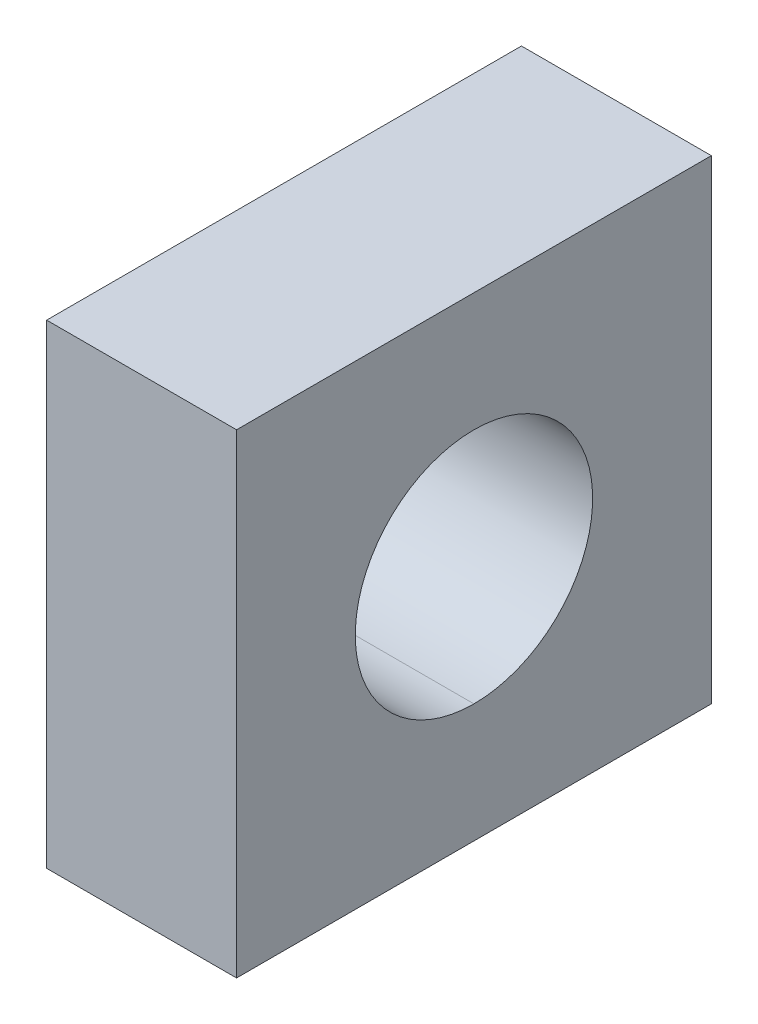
ISO-10303-21;
HEADER;
FILE_DESCRIPTION(('STEP AP214'),'2;1');
FILE_NAME('part.step','',(''),(''),'','','');
FILE_SCHEMA(('AUTOMOTIVE_DESIGN { 1 0 10303 214 1 1 1 1 }'));
ENDSEC;
DATA;
#1=APPLICATION_CONTEXT('core data for automotive mechanical design processes');
#2=APPLICATION_PROTOCOL_DEFINITION('international standard','automotive_design',2000,#1);
#3=PRODUCT_CONTEXT('',#1,'mechanical');
#4=PRODUCT('Part','Part','',(#3));
#5=PRODUCT_RELATED_PRODUCT_CATEGORY('part','',(#4));
#6=PRODUCT_DEFINITION_FORMATION('','',#4);
#7=PRODUCT_DEFINITION_CONTEXT('part definition',#1,'design');
#8=PRODUCT_DEFINITION('design','',#6,#7);
#9=PRODUCT_DEFINITION_SHAPE('','',#8);
#10=(LENGTH_UNIT() NAMED_UNIT(*) SI_UNIT(.MILLI.,.METRE.));
#11=(NAMED_UNIT(*) PLANE_ANGLE_UNIT() SI_UNIT($,.RADIAN.));
#12=(NAMED_UNIT(*) SI_UNIT($,.STERADIAN.) SOLID_ANGLE_UNIT());
#13=UNCERTAINTY_MEASURE_WITH_UNIT(LENGTH_MEASURE(1.E-05),#10,'distance_accuracy_value','');
#14=(GEOMETRIC_REPRESENTATION_CONTEXT(3) GLOBAL_UNCERTAINTY_ASSIGNED_CONTEXT((#13)) GLOBAL_UNIT_ASSIGNED_CONTEXT((#10,
#11,#12)) REPRESENTATION_CONTEXT('',''));
#15=CARTESIAN_POINT('',(0.,0.,0.));
#16=DIRECTION('',(0.,0.,1.));
#17=DIRECTION('',(1.,0.,0.));
#18=AXIS2_PLACEMENT_3D('',#15,#16,#17);
#19=CARTESIAN_POINT('',(-3.175,0.,0.));
#20=DIRECTION('',(1.,0.,0.));
#21=DIRECTION('',(0.,0.,-1.));
#22=AXIS2_PLACEMENT_3D('',#19,#20,#21);
#23=PLANE('',#22);
#24=DIRECTION('',(0.,1.,0.));
#25=VECTOR('',#24,1.);
#26=CARTESIAN_POINT('',(-3.175,0.,7.9375));
#27=LINE('',#26,#25);
#28=CARTESIAN_POINT('',(-3.175,-7.9375,7.9375));
#29=VERTEX_POINT('',#28);
#30=CARTESIAN_POINT('',(-3.175,7.9375,7.9375));
#31=VERTEX_POINT('',#30);
#32=EDGE_CURVE('E100',#29,#31,#27,.T.);
#33=ORIENTED_EDGE('',*,*,#32,.T.);
#34=DIRECTION('',(0.,0.,-1.));
#35=VECTOR('',#34,1.);
#36=CARTESIAN_POINT('',(-3.175,7.9375,0.));
#37=LINE('',#36,#35);
#38=CARTESIAN_POINT('',(-3.175,7.9375,-7.9375));
#39=VERTEX_POINT('',#38);
#40=EDGE_CURVE('E96',#31,#39,#37,.T.);
#41=ORIENTED_EDGE('',*,*,#40,.T.);
#42=DIRECTION('',(0.,1.,0.));
#43=VECTOR('',#42,1.);
#44=CARTESIAN_POINT('',(-3.175,0.,-7.9375));
#45=LINE('',#44,#43);
#46=CARTESIAN_POINT('',(-3.175,-7.9375,-7.9375));
#47=VERTEX_POINT('',#46);
#48=EDGE_CURVE('E92',#39,#47,#45,.F.);
#49=ORIENTED_EDGE('',*,*,#48,.T.);
#50=DIRECTION('',(0.,0.,1.));
#51=VECTOR('',#50,1.);
#52=CARTESIAN_POINT('',(-3.175,-7.9375,0.));
#53=LINE('',#52,#51);
#54=EDGE_CURVE('E80',#47,#29,#53,.T.);
#55=ORIENTED_EDGE('',*,*,#54,.T.);
#56=EDGE_LOOP('',(#33,#41,#49,#55));
#57=FACE_BOUND('',#56,.T.);
#58=CARTESIAN_POINT('',(-3.175,0.,0.));
#59=DIRECTION('',(-1.,0.,0.));
#60=DIRECTION('',(0.,0.,1.));
#61=AXIS2_PLACEMENT_3D('',#58,#59,#60);
#62=CIRCLE('',#61,3.96875);
#63=CARTESIAN_POINT('',(-3.175,-3.96875,0.));
#64=VERTEX_POINT('',#63);
#65=CARTESIAN_POINT('',(-3.175,3.96875,0.));
#66=VERTEX_POINT('',#65);
#67=EDGE_CURVE('E67',#64,#66,#62,.F.);
#68=ORIENTED_EDGE('',*,*,#67,.T.);
#69=CARTESIAN_POINT('',(-3.175,0.,0.));
#70=DIRECTION('',(-1.,0.,0.));
#71=DIRECTION('',(0.,0.,1.));
#72=AXIS2_PLACEMENT_3D('',#69,#70,#71);
#73=CIRCLE('',#72,3.96875);
#74=EDGE_CURVE('E19',#66,#64,#73,.F.);
#75=ORIENTED_EDGE('',*,*,#74,.T.);
#76=EDGE_LOOP('',(#68,#75));
#77=FACE_BOUND('',#76,.T.);
#78=ADVANCED_FACE('F16',(#57,#77),#23,.F.);
#79=CARTESIAN_POINT('',(6.35,0.,0.));
#80=DIRECTION('',(-1.,0.,0.));
#81=DIRECTION('',(0.,0.,1.));
#82=AXIS2_PLACEMENT_3D('',#79,#80,#81);
#83=CYLINDRICAL_SURFACE('',#82,3.96875);
#84=ORIENTED_EDGE('',*,*,#74,.F.);
#85=DIRECTION('',(-1.,0.,0.));
#86=VECTOR('',#85,1.);
#87=CARTESIAN_POINT('',(6.35,3.96875,0.));
#88=LINE('',#87,#86);
#89=CARTESIAN_POINT('',(3.175,3.96875,0.));
#90=VERTEX_POINT('',#89);
#91=EDGE_CURVE('E81',#66,#90,#88,.F.);
#92=ORIENTED_EDGE('',*,*,#91,.T.);
#93=CARTESIAN_POINT('',(3.175,0.,0.));
#94=DIRECTION('',(-1.,0.,0.));
#95=DIRECTION('',(0.,0.,1.));
#96=AXIS2_PLACEMENT_3D('',#93,#94,#95);
#97=CIRCLE('',#96,3.96875);
#98=CARTESIAN_POINT('',(3.175,-3.96875,0.));
#99=VERTEX_POINT('',#98);
#100=EDGE_CURVE('E76',#99,#90,#97,.T.);
#101=ORIENTED_EDGE('',*,*,#100,.F.);
#102=DIRECTION('',(-1.,0.,0.));
#103=VECTOR('',#102,1.);
#104=CARTESIAN_POINT('',(6.35,-3.96875,0.));
#105=LINE('',#104,#103);
#106=EDGE_CURVE('E73',#99,#64,#105,.T.);
#107=ORIENTED_EDGE('',*,*,#106,.T.);
#108=EDGE_LOOP('',(#84,#92,#101,#107));
#109=FACE_BOUND('',#108,.T.);
#110=ADVANCED_FACE('F74',(#109),#83,.F.);
#111=CARTESIAN_POINT('',(6.35,0.,0.));
#112=DIRECTION('',(-1.,0.,0.));
#113=DIRECTION('',(0.,0.,1.));
#114=AXIS2_PLACEMENT_3D('',#111,#112,#113);
#115=CYLINDRICAL_SURFACE('',#114,3.96875);
#116=CARTESIAN_POINT('',(3.175,0.,0.));
#117=DIRECTION('',(-1.,0.,0.));
#118=DIRECTION('',(0.,0.,1.));
#119=AXIS2_PLACEMENT_3D('',#116,#117,#118);
#120=CIRCLE('',#119,3.96875);
#121=EDGE_CURVE('E87',#90,#99,#120,.T.);
#122=ORIENTED_EDGE('',*,*,#121,.F.);
#123=ORIENTED_EDGE('',*,*,#91,.F.);
#124=ORIENTED_EDGE('',*,*,#67,.F.);
#125=ORIENTED_EDGE('',*,*,#106,.F.);
#126=EDGE_LOOP('',(#122,#123,#124,#125));
#127=FACE_BOUND('',#126,.T.);
#128=ADVANCED_FACE('F83',(#127),#115,.F.);
#129=CARTESIAN_POINT('',(0.,-7.9375,0.));
#130=DIRECTION('',(0.,1.,0.));
#131=DIRECTION('',(0.,0.,1.));
#132=AXIS2_PLACEMENT_3D('',#129,#130,#131);
#133=PLANE('',#132);
#134=DIRECTION('',(0.,0.,-1.));
#135=VECTOR('',#134,1.);
#136=CARTESIAN_POINT('',(3.175,-7.9375,0.));
#137=LINE('',#136,#135);
#138=CARTESIAN_POINT('',(3.175,-7.9375,7.9375));
#139=VERTEX_POINT('',#138);
#140=CARTESIAN_POINT('',(3.175,-7.9375,-7.9375));
#141=VERTEX_POINT('',#140);
#142=EDGE_CURVE('E89',#139,#141,#137,.T.);
#143=ORIENTED_EDGE('',*,*,#142,.F.);
#144=DIRECTION('',(-1.,0.,0.));
#145=VECTOR('',#144,1.);
#146=CARTESIAN_POINT('',(0.,-7.9375,7.9375));
#147=LINE('',#146,#145);
#148=EDGE_CURVE('E88',#139,#29,#147,.T.);
#149=ORIENTED_EDGE('',*,*,#148,.T.);
#150=ORIENTED_EDGE('',*,*,#54,.F.);
#151=DIRECTION('',(1.,0.,0.));
#152=VECTOR('',#151,1.);
#153=CARTESIAN_POINT('',(0.,-7.9375,-7.9375));
#154=LINE('',#153,#152);
#155=EDGE_CURVE('E94',#47,#141,#154,.T.);
#156=ORIENTED_EDGE('',*,*,#155,.T.);
#157=EDGE_LOOP('',(#143,#149,#150,#156));
#158=FACE_BOUND('',#157,.T.);
#159=ADVANCED_FACE('F124',(#158),#133,.F.);
#160=CARTESIAN_POINT('',(0.,0.,-7.9375));
#161=DIRECTION('',(0.,0.,1.));
#162=DIRECTION('',(1.,0.,0.));
#163=AXIS2_PLACEMENT_3D('',#160,#161,#162);
#164=PLANE('',#163);
#165=DIRECTION('',(0.,1.,0.));
#166=VECTOR('',#165,1.);
#167=CARTESIAN_POINT('',(3.175,0.,-7.9375));
#168=LINE('',#167,#166);
#169=CARTESIAN_POINT('',(3.175,7.9375,-7.9375));
#170=VERTEX_POINT('',#169);
#171=EDGE_CURVE('E107',#141,#170,#168,.T.);
#172=ORIENTED_EDGE('',*,*,#171,.F.);
#173=ORIENTED_EDGE('',*,*,#155,.F.);
#174=ORIENTED_EDGE('',*,*,#48,.F.);
#175=DIRECTION('',(1.,0.,0.));
#176=VECTOR('',#175,1.);
#177=CARTESIAN_POINT('',(0.,7.9375,-7.9375));
#178=LINE('',#177,#176);
#179=EDGE_CURVE('E98',#39,#170,#178,.T.);
#180=ORIENTED_EDGE('',*,*,#179,.T.);
#181=EDGE_LOOP('',(#172,#173,#174,#180));
#182=FACE_BOUND('',#181,.T.);
#183=ADVANCED_FACE('F119',(#182),#164,.F.);
#184=CARTESIAN_POINT('',(0.,7.9375,0.));
#185=DIRECTION('',(0.,-1.,0.));
#186=DIRECTION('',(0.,0.,-1.));
#187=AXIS2_PLACEMENT_3D('',#184,#185,#186);
#188=PLANE('',#187);
#189=DIRECTION('',(0.,0.,-1.));
#190=VECTOR('',#189,1.);
#191=CARTESIAN_POINT('',(3.175,7.9375,0.));
#192=LINE('',#191,#190);
#193=CARTESIAN_POINT('',(3.175,7.9375,7.9375));
#194=VERTEX_POINT('',#193);
#195=EDGE_CURVE('E25',#170,#194,#192,.F.);
#196=ORIENTED_EDGE('',*,*,#195,.F.);
#197=ORIENTED_EDGE('',*,*,#179,.F.);
#198=ORIENTED_EDGE('',*,*,#40,.F.);
#199=DIRECTION('',(-1.,0.,0.));
#200=VECTOR('',#199,1.);
#201=CARTESIAN_POINT('',(0.,7.9375,7.9375));
#202=LINE('',#201,#200);
#203=EDGE_CURVE('E34',#31,#194,#202,.F.);
#204=ORIENTED_EDGE('',*,*,#203,.T.);
#205=EDGE_LOOP('',(#196,#197,#198,#204));
#206=FACE_BOUND('',#205,.T.);
#207=ADVANCED_FACE('F116',(#206),#188,.F.);
#208=CARTESIAN_POINT('',(0.,0.,7.9375));
#209=DIRECTION('',(0.,0.,-1.));
#210=DIRECTION('',(-1.,0.,0.));
#211=AXIS2_PLACEMENT_3D('',#208,#209,#210);
#212=PLANE('',#211);
#213=DIRECTION('',(0.,1.,0.));
#214=VECTOR('',#213,1.);
#215=CARTESIAN_POINT('',(3.175,0.,7.9375));
#216=LINE('',#215,#214);
#217=EDGE_CURVE('E11',#194,#139,#216,.F.);
#218=ORIENTED_EDGE('',*,*,#217,.F.);
#219=ORIENTED_EDGE('',*,*,#203,.F.);
#220=ORIENTED_EDGE('',*,*,#32,.F.);
#221=ORIENTED_EDGE('',*,*,#148,.F.);
#222=EDGE_LOOP('',(#218,#219,#220,#221));
#223=FACE_BOUND('',#222,.T.);
#224=ADVANCED_FACE('F128',(#223),#212,.F.);
#225=CARTESIAN_POINT('',(3.175,0.,0.));
#226=DIRECTION('',(1.,0.,0.));
#227=DIRECTION('',(0.,0.,-1.));
#228=AXIS2_PLACEMENT_3D('',#225,#226,#227);
#229=PLANE('',#228);
#230=ORIENTED_EDGE('',*,*,#195,.T.);
#231=ORIENTED_EDGE('',*,*,#217,.T.);
#232=ORIENTED_EDGE('',*,*,#142,.T.);
#233=ORIENTED_EDGE('',*,*,#171,.T.);
#234=EDGE_LOOP('',(#230,#231,#232,#233));
#235=FACE_BOUND('',#234,.T.);
#236=ORIENTED_EDGE('',*,*,#100,.T.);
#237=ORIENTED_EDGE('',*,*,#121,.T.);
#238=EDGE_LOOP('',(#236,#237));
#239=FACE_BOUND('',#238,.T.);
#240=ADVANCED_FACE('F112',(#235,#239),#229,.T.);
#241=CLOSED_SHELL('',(#78,#110,#128,#159,#183,#207,#224,#240));
#242=MANIFOLD_SOLID_BREP('B1',#241);
#243=ADVANCED_BREP_SHAPE_REPRESENTATION('',(#18,#242),#14);
#244=SHAPE_DEFINITION_REPRESENTATION(#9,#243);
ENDSEC;
END-ISO-10303-21;
